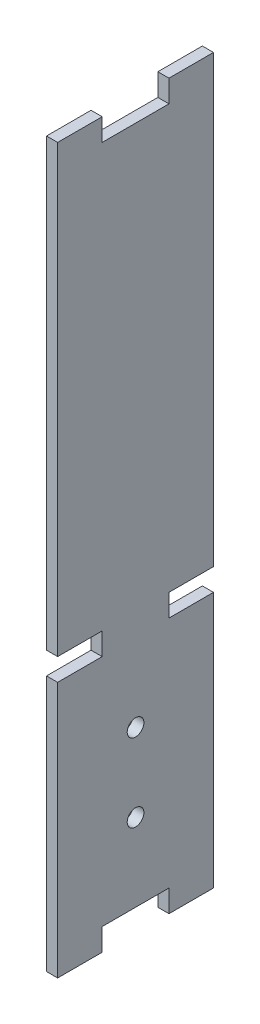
from build123d import *

# Parameters (mm, degrees)
SKETCH1_R      = 2.38125
EXTRUDE1_DEPTH = 3.175


with BuildPart() as part:
    # Sketch1 → Extrude1 (new body)
    with BuildSketch(Plane(origin=(0, 0, 0), x_dir=(0, 0, -1), z_dir=(1, 0, 0))):
        Polygon((-9.525, 0), (9.525, 0), (9.525, -6.35), (22.225, -6.35), (22.225, 66.675), (9.525, 66.675), (9.525, 73.025), (22.225, 73.025), (22.225, 200.025), (9.525, 200.025), (9.525, 193.675), (-9.525, 193.675), (-9.525, 200.025), (-22.225, 200.025), (-22.225, 73.025), (-9.525, 73.025), (-9.525, 66.675), (-22.225, 66.675), (-22.225, -6.35), (-9.525, -6.35), align=None)
        with Locations((0, 44.45)):
            Circle(SKETCH1_R, mode=Mode.SUBTRACT)
        with Locations((0, 22.225)):
            Circle(SKETCH1_R, mode=Mode.SUBTRACT)
    extrude(amount=EXTRUDE1_DEPTH)


solid = part.part
